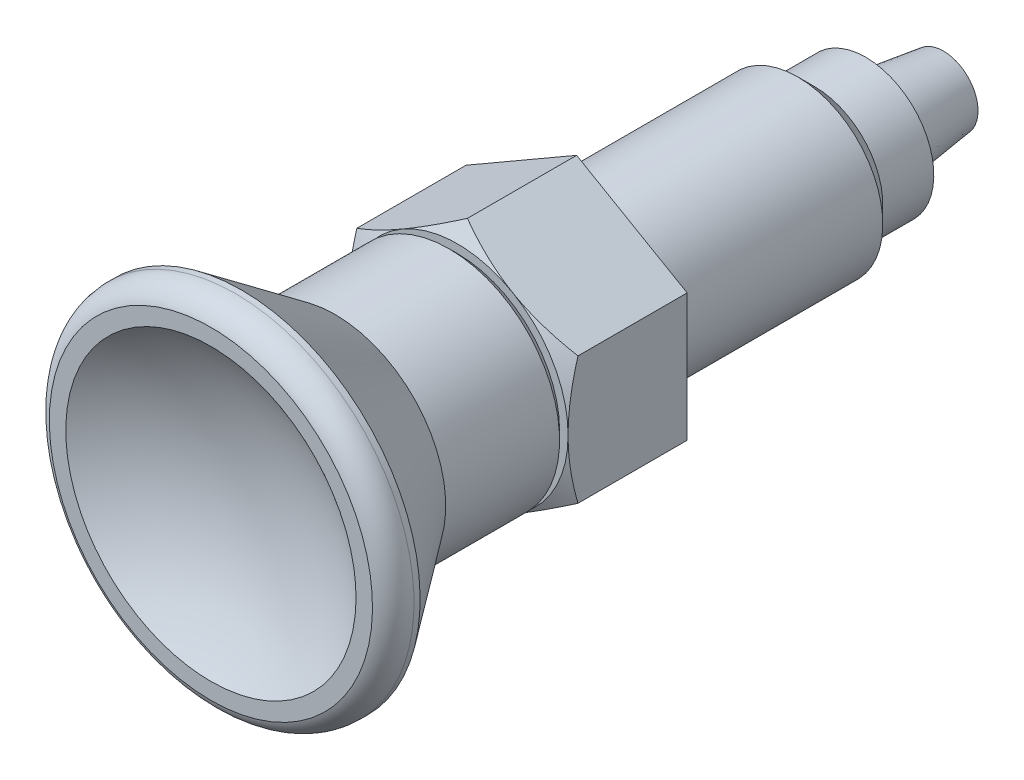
ISO-10303-21;
HEADER;
FILE_DESCRIPTION(('STEP AP214'),'2;1');
FILE_NAME('part.step','',(''),(''),'','','');
FILE_SCHEMA(('AUTOMOTIVE_DESIGN { 1 0 10303 214 1 1 1 1 }'));
ENDSEC;
DATA;
#1=APPLICATION_CONTEXT('core data for automotive mechanical design processes');
#2=APPLICATION_PROTOCOL_DEFINITION('international standard','automotive_design',2000,#1);
#3=PRODUCT_CONTEXT('',#1,'mechanical');
#4=PRODUCT('Part','Part','',(#3));
#5=PRODUCT_RELATED_PRODUCT_CATEGORY('part','',(#4));
#6=PRODUCT_DEFINITION_FORMATION('','',#4);
#7=PRODUCT_DEFINITION_CONTEXT('part definition',#1,'design');
#8=PRODUCT_DEFINITION('design','',#6,#7);
#9=PRODUCT_DEFINITION_SHAPE('','',#8);
#10=(LENGTH_UNIT() NAMED_UNIT(*) SI_UNIT(.MILLI.,.METRE.));
#11=(NAMED_UNIT(*) PLANE_ANGLE_UNIT() SI_UNIT($,.RADIAN.));
#12=(NAMED_UNIT(*) SI_UNIT($,.STERADIAN.) SOLID_ANGLE_UNIT());
#13=UNCERTAINTY_MEASURE_WITH_UNIT(LENGTH_MEASURE(1.E-05),#10,'distance_accuracy_value','');
#14=(GEOMETRIC_REPRESENTATION_CONTEXT(3) GLOBAL_UNCERTAINTY_ASSIGNED_CONTEXT((#13)) GLOBAL_UNIT_ASSIGNED_CONTEXT((#10,
#11,#12)) REPRESENTATION_CONTEXT('',''));
#15=CARTESIAN_POINT('',(0.,0.,0.));
#16=DIRECTION('',(0.,0.,1.));
#17=DIRECTION('',(1.,0.,0.));
#18=AXIS2_PLACEMENT_3D('',#15,#16,#17);
#19=CARTESIAN_POINT('',(0.,0.,-17.));
#20=DIRECTION('',(0.,0.,1.));
#21=DIRECTION('',(0.,1.,0.));
#22=AXIS2_PLACEMENT_3D('',#19,#20,#21);
#23=CYLINDRICAL_SURFACE('',#22,5.);
#24=CARTESIAN_POINT('',(0.,0.,0.));
#25=DIRECTION('',(0.,0.,1.));
#26=DIRECTION('',(0.,1.,0.));
#27=AXIS2_PLACEMENT_3D('',#24,#25,#26);
#28=CIRCLE('',#27,5.);
#29=CARTESIAN_POINT('',(0.,5.,0.));
#30=VERTEX_POINT('',#29);
#31=EDGE_CURVE('E359',#30,#30,#28,.T.);
#32=ORIENTED_EDGE('',*,*,#31,.F.);
#33=EDGE_LOOP('',(#32));
#34=FACE_BOUND('',#33,.T.);
#35=CARTESIAN_POINT('',(0.,0.,-13.));
#36=DIRECTION('',(0.,0.,1.));
#37=DIRECTION('',(0.,1.,0.));
#38=AXIS2_PLACEMENT_3D('',#35,#36,#37);
#39=CIRCLE('',#38,5.);
#40=CARTESIAN_POINT('',(0.,5.,-13.));
#41=VERTEX_POINT('',#40);
#42=EDGE_CURVE('E362',#41,#41,#39,.T.);
#43=ORIENTED_EDGE('',*,*,#42,.T.);
#44=EDGE_LOOP('',(#43));
#45=FACE_BOUND('',#44,.T.);
#46=ADVANCED_FACE('F14',(#34,#45),#23,.T.);
#47=CARTESIAN_POINT('',(-5.,0.,0.));
#48=DIRECTION('',(0.,0.,-1.));
#49=DIRECTION('',(0.,-1.,0.));
#50=AXIS2_PLACEMENT_3D('',#47,#48,#49);
#51=PLANE('',#50);
#52=ORIENTED_EDGE('',*,*,#31,.T.);
#53=EDGE_LOOP('',(#52));
#54=FACE_BOUND('',#53,.T.);
#55=DIRECTION('',(0.,1.,0.));
#56=VECTOR('',#55,1.);
#57=CARTESIAN_POINT('',(6.5,-3.75277674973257,0.));
#58=LINE('',#57,#56);
#59=CARTESIAN_POINT('',(6.5,-3.75277674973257,0.));
#60=VERTEX_POINT('',#59);
#61=CARTESIAN_POINT('',(6.5,3.75277674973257,0.));
#62=VERTEX_POINT('',#61);
#63=EDGE_CURVE('E425',#60,#62,#58,.T.);
#64=ORIENTED_EDGE('',*,*,#63,.F.);
#65=DIRECTION('',(0.866025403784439,0.5,0.));
#66=VECTOR('',#65,1.);
#67=CARTESIAN_POINT('',(0.,-7.50555349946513,0.));
#68=LINE('',#67,#66);
#69=CARTESIAN_POINT('',(0.,-7.50555349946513,0.));
#70=VERTEX_POINT('',#69);
#71=EDGE_CURVE('E430',#70,#60,#68,.T.);
#72=ORIENTED_EDGE('',*,*,#71,.F.);
#73=DIRECTION('',(0.866025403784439,-0.5,0.));
#74=VECTOR('',#73,1.);
#75=CARTESIAN_POINT('',(-6.5,-3.75277674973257,0.));
#76=LINE('',#75,#74);
#77=CARTESIAN_POINT('',(-6.5,-3.75277674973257,0.));
#78=VERTEX_POINT('',#77);
#79=EDGE_CURVE('E376',#78,#70,#76,.T.);
#80=ORIENTED_EDGE('',*,*,#79,.F.);
#81=DIRECTION('',(0.,-1.,0.));
#82=VECTOR('',#81,1.);
#83=CARTESIAN_POINT('',(-6.5,3.75277674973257,0.));
#84=LINE('',#83,#82);
#85=CARTESIAN_POINT('',(-6.5,3.75277674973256,0.));
#86=VERTEX_POINT('',#85);
#87=EDGE_CURVE('E361',#86,#78,#84,.T.);
#88=ORIENTED_EDGE('',*,*,#87,.F.);
#89=DIRECTION('',(-0.866025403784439,-0.5,0.));
#90=VECTOR('',#89,1.);
#91=CARTESIAN_POINT('',(0.,7.50555349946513,0.));
#92=LINE('',#91,#90);
#93=CARTESIAN_POINT('',(0.,7.50555349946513,0.));
#94=VERTEX_POINT('',#93);
#95=EDGE_CURVE('E80',#94,#86,#92,.T.);
#96=ORIENTED_EDGE('',*,*,#95,.F.);
#97=DIRECTION('',(-0.866025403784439,0.5,0.));
#98=VECTOR('',#97,1.);
#99=CARTESIAN_POINT('',(6.5,3.75277674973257,0.));
#100=LINE('',#99,#98);
#101=EDGE_CURVE('E77',#62,#94,#100,.T.);
#102=ORIENTED_EDGE('',*,*,#101,.F.);
#103=EDGE_LOOP('',(#64,#72,#80,#88,#96,#102));
#104=FACE_BOUND('',#103,.T.);
#105=ADVANCED_FACE('F196',(#54,#104),#51,.T.);
#106=CARTESIAN_POINT('',(-6.5,3.75277674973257,0.));
#107=DIRECTION('',(-1.,0.,0.));
#108=DIRECTION('',(0.,-1.,0.));
#109=AXIS2_PLACEMENT_3D('',#106,#107,#108);
#110=PLANE('',#109);
#111=CARTESIAN_POINT('',(-6.5,0.,7.));
#112=CARTESIAN_POINT('',(-6.5,-0.159284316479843,7.0000265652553));
#113=CARTESIAN_POINT('',(-6.5,-0.318560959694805,6.99662027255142));
#114=CARTESIAN_POINT('',(-6.5,-0.636801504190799,6.98313941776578));
#115=CARTESIAN_POINT('',(-6.5,-0.795765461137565,6.97306617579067));
#116=CARTESIAN_POINT('',(-6.5,-1.11235385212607,6.94651520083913));
#117=CARTESIAN_POINT('',(-6.5,-1.26998101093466,6.93006970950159));
#118=CARTESIAN_POINT('',(-6.5,-1.58448433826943,6.89112798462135));
#119=CARTESIAN_POINT('',(-6.5,-1.74136048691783,6.86863159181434));
#120=CARTESIAN_POINT('',(-6.5,-2.2102121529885,6.79276103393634));
#121=CARTESIAN_POINT('',(-6.5,-2.52082563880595,6.73096864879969));
#122=CARTESIAN_POINT('',(-6.5,-3.13938147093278,6.58845960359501));
#123=CARTESIAN_POINT('',(-6.5,-3.44730224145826,6.50764843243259));
#124=CARTESIAN_POINT('',(-6.5,-3.75277666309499,6.41944344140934));
#125=B_SPLINE_CURVE_WITH_KNOTS('',3,(#111,#112,#113,#114,#115,#116,#117,#118,#119,#120,#121,
#122,#123,#124),.UNSPECIFIED.,.F.,.F.,(4,2,2,2,2,2,4),(0.,0.477804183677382,0.955513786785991,
1.43083723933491,1.90617320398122,2.85559928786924,3.80984692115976),.UNSPECIFIED.);
#126=CARTESIAN_POINT('',(-6.5,0.,7.));
#127=VERTEX_POINT('',#126);
#128=CARTESIAN_POINT('',(-6.50000001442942,-3.75277674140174,6.41944341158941));
#129=VERTEX_POINT('',#128);
#130=EDGE_CURVE('E200',#127,#129,#125,.T.);
#131=ORIENTED_EDGE('',*,*,#130,.F.);
#132=CARTESIAN_POINT('',(-6.499999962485,3.75277677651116,6.41944338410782));
#133=CARTESIAN_POINT('',(-6.49999998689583,3.44730234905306,6.50764839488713));
#134=CARTESIAN_POINT('',(-6.49999999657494,3.1393815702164,6.58845957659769));
#135=CARTESIAN_POINT('',(-6.50000000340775,2.5208257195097,6.73096863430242));
#136=CARTESIAN_POINT('',(-6.50000000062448,2.21021222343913,6.79276102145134));
#137=CARTESIAN_POINT('',(-6.49999999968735,1.74136054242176,6.86863158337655));
#138=CARTESIAN_POINT('',(-6.49999999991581,1.58448438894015,6.89112797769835));
#139=CARTESIAN_POINT('',(-6.50000000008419,1.26998105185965,6.93006970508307));
#140=CARTESIAN_POINT('',(-6.5000000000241,1.1123538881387,6.94651519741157));
#141=CARTESIAN_POINT('',(-6.49999999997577,0.79576548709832,6.97306617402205));
#142=CARTESIAN_POINT('',(-6.49999999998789,0.636801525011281,6.98313941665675));
#143=CARTESIAN_POINT('',(-6.50000000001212,0.318560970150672,6.996620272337));
#144=CARTESIAN_POINT('',(-6.50000000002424,0.159284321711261,7.00002656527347));
#145=CARTESIAN_POINT('',(-6.5,0.,7.));
#146=B_SPLINE_CURVE_WITH_KNOTS('',3,(#132,#133,#134,#135,#136,#137,#138,#139,#140,#141,#142,
#143,#144,#145),.UNSPECIFIED.,.F.,.F.,(4,2,2,2,2,2,4),(0.,0.954247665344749,1.90367378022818,
2.37900975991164,2.85433322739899,3.33204284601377,3.80984704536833),.UNSPECIFIED.);
#147=CARTESIAN_POINT('',(-6.5,3.75277676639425,6.41944341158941));
#148=VERTEX_POINT('',#147);
#149=EDGE_CURVE('E206',#148,#127,#146,.T.);
#150=ORIENTED_EDGE('',*,*,#149,.F.);
#151=DIRECTION('',(0.,0.,1.));
#152=VECTOR('',#151,1.);
#153=CARTESIAN_POINT('',(-6.5,3.75277674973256,0.));
#154=LINE('',#153,#152);
#155=EDGE_CURVE('E264',#86,#148,#154,.T.);
#156=ORIENTED_EDGE('',*,*,#155,.F.);
#157=ORIENTED_EDGE('',*,*,#87,.T.);
#158=DIRECTION('',(0.,0.,1.));
#159=VECTOR('',#158,1.);
#160=CARTESIAN_POINT('',(-6.5,-3.75277674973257,0.));
#161=LINE('',#160,#159);
#162=EDGE_CURVE('E366',#129,#78,#161,.F.);
#163=ORIENTED_EDGE('',*,*,#162,.F.);
#164=EDGE_LOOP('',(#131,#150,#156,#157,#163));
#165=FACE_BOUND('',#164,.T.);
#166=ADVANCED_FACE('F190',(#165),#110,.T.);
#167=CARTESIAN_POINT('',(-6.5,-3.75277674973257,0.));
#168=DIRECTION('',(-0.5,-0.866025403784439,0.));
#169=DIRECTION('',(0.866025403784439,-0.5,0.));
#170=AXIS2_PLACEMENT_3D('',#167,#168,#169);
#171=PLANE('',#170);
#172=CARTESIAN_POINT('',(-3.25,-5.62916512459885,7.));
#173=CARTESIAN_POINT('',(-3.1120557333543,-5.70880728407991,7.00002656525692));
#174=CARTESIAN_POINT('',(-2.97411811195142,-5.78844560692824,6.9966202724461));
#175=CARTESIAN_POINT('',(-2.69851371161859,-5.94756588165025,6.98313941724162));
#176=CARTESIAN_POINT('',(-2.5608468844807,-6.02704786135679,6.97306617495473));
#177=CARTESIAN_POINT('',(-2.28667329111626,-6.18534205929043,6.9465151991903));
#178=CARTESIAN_POINT('',(-2.15016416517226,-6.26415563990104,6.9300697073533));
#179=CARTESIAN_POINT('',(-1.87779628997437,-6.42140730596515,6.89112798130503));
#180=CARTESIAN_POINT('',(-1.74193755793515,-6.49984538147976,6.86863158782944));
#181=CARTESIAN_POINT('',(-1.33590009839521,-6.73427121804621,6.79276102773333));
#182=CARTESIAN_POINT('',(-1.06690092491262,-6.88957796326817,6.73096864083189));
#183=CARTESIAN_POINT('',(-0.531215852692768,-7.19885588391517,6.58845959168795));
#184=CARTESIAN_POINT('',(-0.264548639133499,-7.35281627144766,6.50764841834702));
#185=CARTESIAN_POINT('',(-2.59197373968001E-08,-7.50555348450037,6.41944342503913));
#186=B_SPLINE_CURVE_WITH_KNOTS('',3,(#172,#173,#174,#175,#176,#177,#178,#179,#180,#181,#182,
#183,#184,#185),.UNSPECIFIED.,.F.,.F.,(4,2,2,2,2,2,4),(0.,0.477804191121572,0.955513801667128,
1.43083726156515,1.90617323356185,2.85559933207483,3.80984698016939),.UNSPECIFIED.);
#187=CARTESIAN_POINT('',(-3.25,-5.62916512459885,7.));
#188=VERTEX_POINT('',#187);
#189=CARTESIAN_POINT('',(1.15429025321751E-08,-7.50555349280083,6.41944342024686));
#190=VERTEX_POINT('',#189);
#191=EDGE_CURVE('E173',#188,#190,#186,.T.);
#192=ORIENTED_EDGE('',*,*,#191,.F.);
#193=CARTESIAN_POINT('',(-6.50000000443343,-3.7527767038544,6.41944338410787));
#194=CARTESIAN_POINT('',(-6.2354514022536,-3.90551393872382,6.50764839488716));
#195=CARTESIAN_POINT('',(-5.96878419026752,-4.0594743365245,6.5884595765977));
#196=CARTESIAN_POINT('',(-5.43309911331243,-4.36875226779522,6.73096863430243));
#197=CARTESIAN_POINT('',(-5.16409993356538,-4.52405901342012,6.79276102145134));
#198=CARTESIAN_POINT('',(-4.75806246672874,-4.75848485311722,6.86863158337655));
#199=CARTESIAN_POINT('',(-4.62220373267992,-4.83692293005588,6.89112797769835));
#200=CARTESIAN_POINT('',(-4.34983585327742,-4.99417459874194,6.93006970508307));
#201=CARTESIAN_POINT('',(-4.21332672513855,-5.07298818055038,6.94651519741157));
#202=CARTESIAN_POINT('',(-3.93915312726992,-5.23128238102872,6.97306617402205));
#203=CARTESIAN_POINT('',(-3.80148629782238,-5.31076436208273,6.98313941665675));
#204=CARTESIAN_POINT('',(-3.52588189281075,-5.46988463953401,6.996620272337));
#205=CARTESIAN_POINT('',(-3.38794426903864,-5.54952296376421,7.00002656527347));
#206=CARTESIAN_POINT('',(-3.25,-5.62916512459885,7.));
#207=B_SPLINE_CURVE_WITH_KNOTS('',3,(#193,#194,#195,#196,#197,#198,#199,#200,#201,#202,#203,
#204,#205,#206),.UNSPECIFIED.,.F.,.F.,(4,2,2,2,2,2,4),(0.,0.954247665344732,1.90367378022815,
2.3790097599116,2.85433322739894,3.33204284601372,3.80984704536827),.UNSPECIFIED.);
#208=EDGE_CURVE('E180',#129,#188,#207,.T.);
#209=ORIENTED_EDGE('',*,*,#208,.F.);
#210=ORIENTED_EDGE('',*,*,#162,.T.);
#211=ORIENTED_EDGE('',*,*,#79,.T.);
#212=DIRECTION('',(0.,0.,1.));
#213=VECTOR('',#212,1.);
#214=CARTESIAN_POINT('',(0.,-7.50555349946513,0.));
#215=LINE('',#214,#213);
#216=EDGE_CURVE('E441',#190,#70,#215,.F.);
#217=ORIENTED_EDGE('',*,*,#216,.F.);
#218=EDGE_LOOP('',(#192,#209,#210,#211,#217));
#219=FACE_BOUND('',#218,.T.);
#220=ADVANCED_FACE('F186',(#219),#171,.T.);
#221=CARTESIAN_POINT('',(0.,-7.50555349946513,0.));
#222=DIRECTION('',(0.5,-0.866025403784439,0.));
#223=DIRECTION('',(0.866025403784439,0.5,0.));
#224=AXIS2_PLACEMENT_3D('',#221,#222,#223);
#225=PLANE('',#224);
#226=CARTESIAN_POINT('',(3.25,-5.62916512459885,7.));
#227=CARTESIAN_POINT('',(3.38794426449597,-5.54952296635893,7.0000265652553));
#228=CARTESIAN_POINT('',(3.52588188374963,-5.46988464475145,6.99662027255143));
#229=CARTESIAN_POINT('',(3.80148627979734,-5.31076437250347,6.98313941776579));
#230=CARTESIAN_POINT('',(3.93915310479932,-5.23128239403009,6.97306617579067));
#231=CARTESIAN_POINT('',(4.21332669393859,-5.07298819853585,6.94651520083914));
#232=CARTESIAN_POINT('',(4.34983581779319,-4.99417461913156,6.9300697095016));
#233=CARTESIAN_POINT('',(4.62220368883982,-4.83692295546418,6.89112798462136));
#234=CARTESIAN_POINT('',(4.75806241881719,-4.75848488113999,6.86863159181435));
#235=CARTESIAN_POINT('',(5.16409987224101,-4.52405904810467,6.79276103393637));
#236=CARTESIAN_POINT('',(5.43309904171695,-4.36875230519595,6.73096864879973));
#237=CARTESIAN_POINT('',(5.96878410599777,-4.05947438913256,6.58845960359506));
#238=CARTESIAN_POINT('',(6.2354513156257,-3.90551400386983,6.50764843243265));
#239=CARTESIAN_POINT('',(6.49999992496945,-3.75277679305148,6.41944344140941));
#240=B_SPLINE_CURVE_WITH_KNOTS('',3,(#226,#227,#228,#229,#230,#231,#232,#233,#234,#235,#236,
#237,#238,#239),.UNSPECIFIED.,.F.,.F.,(4,2,2,2,2,2,4),(0.,0.477804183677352,0.95551378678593,
1.43083723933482,1.9061732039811,2.85559928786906,3.80984692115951),.UNSPECIFIED.);
#241=CARTESIAN_POINT('',(3.25,-5.62916512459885,7.));
#242=VERTEX_POINT('',#241);
#243=CARTESIAN_POINT('',(6.5,-3.75277676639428,6.4194434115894));
#244=VERTEX_POINT('',#243);
#245=EDGE_CURVE('E145',#242,#244,#240,.T.);
#246=ORIENTED_EDGE('',*,*,#245,.F.);
#247=CARTESIAN_POINT('',(1.65411278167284E-08,-7.50555346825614,6.41944341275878));
#248=CARTESIAN_POINT('',(0.264548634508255,-7.35281626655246,6.50764841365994));
#249=CARTESIAN_POINT('',(0.531215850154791,-7.19885588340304,6.58845959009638));
#250=CARTESIAN_POINT('',(1.06690092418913,-6.88957796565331,6.73096864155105));
#251=CARTESIAN_POINT('',(1.335900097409,-6.73427121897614,6.79276102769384));
#252=CARTESIAN_POINT('',(1.74193755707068,-6.49984538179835,6.86863158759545));
#253=CARTESIAN_POINT('',(1.87779628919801,-6.42140730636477,6.89112798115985));
#254=CARTESIAN_POINT('',(2.15016416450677,-6.26415564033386,6.93006970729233));
#255=CARTESIAN_POINT('',(2.28667329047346,-6.18534205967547,6.94651519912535));
#256=CARTESIAN_POINT('',(2.56084688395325,-6.02704786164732,6.97306617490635));
#257=CARTESIAN_POINT('',(2.69851371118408,-5.94756588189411,6.98313941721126));
#258=CARTESIAN_POINT('',(2.97411811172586,-5.78844560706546,6.99662027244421));
#259=CARTESIAN_POINT('',(3.11205573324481,-5.70880728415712,7.00002656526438));
#260=CARTESIAN_POINT('',(3.25,-5.62916512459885,7.));
#261=B_SPLINE_CURVE_WITH_KNOTS('',3,(#247,#248,#249,#250,#251,#252,#253,#254,#255,#256,#257,
#258,#259,#260),.UNSPECIFIED.,.F.,.F.,(4,2,2,2,2,2,4),(0.,0.954247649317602,1.90367374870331,
2.37900972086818,2.85433318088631,3.332042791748,3.80984698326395),.UNSPECIFIED.);
#262=EDGE_CURVE('E167',#190,#242,#261,.T.);
#263=ORIENTED_EDGE('',*,*,#262,.F.);
#264=ORIENTED_EDGE('',*,*,#216,.T.);
#265=ORIENTED_EDGE('',*,*,#71,.T.);
#266=DIRECTION('',(0.,0.,1.));
#267=VECTOR('',#266,1.);
#268=CARTESIAN_POINT('',(6.5,-3.75277674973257,0.));
#269=LINE('',#268,#267);
#270=EDGE_CURVE('E435',#244,#60,#269,.F.);
#271=ORIENTED_EDGE('',*,*,#270,.F.);
#272=EDGE_LOOP('',(#246,#263,#264,#265,#271));
#273=FACE_BOUND('',#272,.T.);
#274=ADVANCED_FACE('F127',(#273),#225,.T.);
#275=CARTESIAN_POINT('',(6.5,-3.75277674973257,0.));
#276=DIRECTION('',(1.,0.,0.));
#277=DIRECTION('',(0.,1.,0.));
#278=AXIS2_PLACEMENT_3D('',#275,#276,#277);
#279=PLANE('',#278);
#280=CARTESIAN_POINT('',(6.5,0.,7.));
#281=CARTESIAN_POINT('',(6.5,0.159284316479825,7.0000265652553));
#282=CARTESIAN_POINT('',(6.5,0.318560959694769,6.99662027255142));
#283=CARTESIAN_POINT('',(6.5,0.636801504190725,6.98313941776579));
#284=CARTESIAN_POINT('',(6.5,0.795765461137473,6.97306617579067));
#285=CARTESIAN_POINT('',(6.5,1.11235385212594,6.94651520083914));
#286=CARTESIAN_POINT('',(6.5,1.26998101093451,6.93006970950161));
#287=CARTESIAN_POINT('',(6.5,1.58448433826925,6.89112798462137));
#288=CARTESIAN_POINT('',(6.5,1.74136048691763,6.86863159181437));
#289=CARTESIAN_POINT('',(6.5,2.21021215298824,6.79276103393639));
#290=CARTESIAN_POINT('',(6.5,2.52082563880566,6.73096864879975));
#291=CARTESIAN_POINT('',(6.5,3.13938147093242,6.58845960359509));
#292=CARTESIAN_POINT('',(6.5,3.44730224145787,6.50764843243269));
#293=CARTESIAN_POINT('',(6.5,3.75277666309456,6.41944344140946));
#294=B_SPLINE_CURVE_WITH_KNOTS('',3,(#280,#281,#282,#283,#284,#285,#286,#287,#288,#289,#290,
#291,#292,#293),.UNSPECIFIED.,.F.,.F.,(4,2,2,2,2,2,4),(0.,0.477804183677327,0.95551378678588,
1.43083723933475,1.906173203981,2.85559928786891,3.80984692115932),.UNSPECIFIED.);
#295=CARTESIAN_POINT('',(6.5,0.,7.));
#296=VERTEX_POINT('',#295);
#297=CARTESIAN_POINT('',(6.50000001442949,3.7527767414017,6.41944341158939));
#298=VERTEX_POINT('',#297);
#299=EDGE_CURVE('E95',#296,#298,#294,.T.);
#300=ORIENTED_EDGE('',*,*,#299,.F.);
#301=CARTESIAN_POINT('',(6.49999996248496,-3.75277677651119,6.41944338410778));
#302=CARTESIAN_POINT('',(6.49999998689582,-3.44730234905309,6.50764839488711));
#303=CARTESIAN_POINT('',(6.49999999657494,-3.13938157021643,6.58845957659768));
#304=CARTESIAN_POINT('',(6.50000000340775,-2.52082571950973,6.73096863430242));
#305=CARTESIAN_POINT('',(6.50000000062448,-2.21021222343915,6.79276102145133));
#306=CARTESIAN_POINT('',(6.49999999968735,-1.74136054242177,6.86863158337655));
#307=CARTESIAN_POINT('',(6.49999999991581,-1.58448438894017,6.89112797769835));
#308=CARTESIAN_POINT('',(6.50000000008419,-1.26998105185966,6.93006970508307));
#309=CARTESIAN_POINT('',(6.5000000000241,-1.11235388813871,6.94651519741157));
#310=CARTESIAN_POINT('',(6.49999999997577,-0.795765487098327,6.97306617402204));
#311=CARTESIAN_POINT('',(6.49999999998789,-0.636801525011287,6.98313941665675));
#312=CARTESIAN_POINT('',(6.50000000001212,-0.318560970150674,6.996620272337));
#313=CARTESIAN_POINT('',(6.50000000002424,-0.159284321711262,7.00002656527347));
#314=CARTESIAN_POINT('',(6.5,0.,7.));
#315=B_SPLINE_CURVE_WITH_KNOTS('',3,(#301,#302,#303,#304,#305,#306,#307,#308,#309,#310,#311,
#312,#313,#314),.UNSPECIFIED.,.F.,.F.,(4,2,2,2,2,2,4),(0.,0.954247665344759,1.9036737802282,
2.37900975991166,2.85433322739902,3.3320428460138,3.80984704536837),.UNSPECIFIED.);
#316=EDGE_CURVE('E137',#244,#296,#315,.T.);
#317=ORIENTED_EDGE('',*,*,#316,.F.);
#318=ORIENTED_EDGE('',*,*,#270,.T.);
#319=ORIENTED_EDGE('',*,*,#63,.T.);
#320=DIRECTION('',(0.,0.,1.));
#321=VECTOR('',#320,1.);
#322=CARTESIAN_POINT('',(6.5,3.75277674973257,0.));
#323=LINE('',#322,#321);
#324=EDGE_CURVE('E434',#298,#62,#323,.F.);
#325=ORIENTED_EDGE('',*,*,#324,.F.);
#326=EDGE_LOOP('',(#300,#317,#318,#319,#325));
#327=FACE_BOUND('',#326,.T.);
#328=ADVANCED_FACE('F120',(#327),#279,.T.);
#329=CARTESIAN_POINT('',(6.5,3.75277674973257,0.));
#330=DIRECTION('',(0.5,0.866025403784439,0.));
#331=DIRECTION('',(-0.866025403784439,0.5,0.));
#332=AXIS2_PLACEMENT_3D('',#329,#330,#331);
#333=PLANE('',#332);
#334=CARTESIAN_POINT('',(3.25,5.62916512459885,7.));
#335=CARTESIAN_POINT('',(3.11205573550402,5.70880728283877,7.00002656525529));
#336=CARTESIAN_POINT('',(2.97411811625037,5.78844560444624,6.99662027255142));
#337=CARTESIAN_POINT('',(2.69851372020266,5.94756587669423,6.98313941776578));
#338=CARTESIAN_POINT('',(2.56084689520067,6.02704785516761,6.97306617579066));
#339=CARTESIAN_POINT('',(2.2866733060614,6.18534205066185,6.94651520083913));
#340=CARTESIAN_POINT('',(2.15016418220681,6.26415563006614,6.93006970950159));
#341=CARTESIAN_POINT('',(1.87779631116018,6.42140729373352,6.89112798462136));
#342=CARTESIAN_POINT('',(1.74193758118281,6.49984536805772,6.86863159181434));
#343=CARTESIAN_POINT('',(1.33590012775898,6.73427120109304,6.79276103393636));
#344=CARTESIAN_POINT('',(1.06690095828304,6.88957794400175,6.73096864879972));
#345=CARTESIAN_POINT('',(0.531215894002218,7.19885586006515,6.58845960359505));
#346=CARTESIAN_POINT('',(0.264548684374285,7.35281624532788,6.50764843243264));
#347=CARTESIAN_POINT('',(7.50305377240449E-08,7.50555345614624,6.4194434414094));
#348=B_SPLINE_CURVE_WITH_KNOTS('',3,(#334,#335,#336,#337,#338,#339,#340,#341,#342,#343,#344,
#345,#346,#347),.UNSPECIFIED.,.F.,.F.,(4,2,2,2,2,2,4),(0.,0.477804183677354,0.955513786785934,
1.43083723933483,1.90617320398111,2.85559928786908,3.80984692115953),.UNSPECIFIED.);
#349=CARTESIAN_POINT('',(3.25,5.62916512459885,7.));
#350=VERTEX_POINT('',#349);
#351=CARTESIAN_POINT('',(1.44294555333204E-08,7.50555350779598,6.41944341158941));
#352=VERTEX_POINT('',#351);
#353=EDGE_CURVE('E34',#350,#352,#348,.T.);
#354=ORIENTED_EDGE('',*,*,#353,.F.);
#355=CARTESIAN_POINT('',(6.50000000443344,3.75277670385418,6.41944338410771));
#356=CARTESIAN_POINT('',(6.23545140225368,3.9055139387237,6.50764839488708));
#357=CARTESIAN_POINT('',(5.96878419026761,4.05947433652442,6.58845957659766));
#358=CARTESIAN_POINT('',(5.43309911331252,4.36875226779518,6.73096863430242));
#359=CARTESIAN_POINT('',(5.16409993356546,4.52405901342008,6.79276102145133));
#360=CARTESIAN_POINT('',(4.7580624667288,4.75848485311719,6.86863158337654));
#361=CARTESIAN_POINT('',(4.62220373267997,4.83692293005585,6.89112797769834));
#362=CARTESIAN_POINT('',(4.34983585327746,4.99417459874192,6.93006970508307));
#363=CARTESIAN_POINT('',(4.21332672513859,5.07298818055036,6.94651519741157));
#364=CARTESIAN_POINT('',(3.93915312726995,5.2312823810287,6.97306617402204));
#365=CARTESIAN_POINT('',(3.8014862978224,5.31076436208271,6.98313941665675));
#366=CARTESIAN_POINT('',(3.52588189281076,5.469884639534,6.996620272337));
#367=CARTESIAN_POINT('',(3.38794426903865,5.54952296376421,7.00002656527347));
#368=CARTESIAN_POINT('',(3.25,5.62916512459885,7.));
#369=B_SPLINE_CURVE_WITH_KNOTS('',3,(#355,#356,#357,#358,#359,#360,#361,#362,#363,#364,#365,
#366,#367,#368),.UNSPECIFIED.,.F.,.F.,(4,2,2,2,2,2,4),(0.,0.954247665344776,1.90367378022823,
2.3790097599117,2.85433322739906,3.33204284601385,3.80984704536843),.UNSPECIFIED.);
#370=EDGE_CURVE('E93',#298,#350,#369,.T.);
#371=ORIENTED_EDGE('',*,*,#370,.F.);
#372=ORIENTED_EDGE('',*,*,#324,.T.);
#373=ORIENTED_EDGE('',*,*,#101,.T.);
#374=DIRECTION('',(0.,0.,1.));
#375=VECTOR('',#374,1.);
#376=CARTESIAN_POINT('',(0.,7.50555349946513,0.));
#377=LINE('',#376,#375);
#378=EDGE_CURVE('E72',#352,#94,#377,.F.);
#379=ORIENTED_EDGE('',*,*,#378,.F.);
#380=EDGE_LOOP('',(#354,#371,#372,#373,#379));
#381=FACE_BOUND('',#380,.T.);
#382=ADVANCED_FACE('F73',(#381),#333,.T.);
#383=CARTESIAN_POINT('',(0.,7.50555349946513,0.));
#384=DIRECTION('',(-0.5,0.866025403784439,0.));
#385=DIRECTION('',(-0.866025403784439,-0.5,0.));
#386=AXIS2_PLACEMENT_3D('',#383,#384,#385);
#387=PLANE('',#386);
#388=CARTESIAN_POINT('',(-3.25,5.62916512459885,7.));
#389=CARTESIAN_POINT('',(-3.38794426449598,5.54952296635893,7.0000265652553));
#390=CARTESIAN_POINT('',(-3.52588188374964,5.46988464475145,6.99662027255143));
#391=CARTESIAN_POINT('',(-3.80148627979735,5.31076437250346,6.98313941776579));
#392=CARTESIAN_POINT('',(-3.93915310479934,5.23128239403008,6.97306617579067));
#393=CARTESIAN_POINT('',(-4.21332669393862,5.07298819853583,6.94651520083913));
#394=CARTESIAN_POINT('',(-4.34983581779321,4.99417461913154,6.9300697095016));
#395=CARTESIAN_POINT('',(-4.62220368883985,4.83692295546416,6.89112798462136));
#396=CARTESIAN_POINT('',(-4.75806241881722,4.75848488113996,6.86863159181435));
#397=CARTESIAN_POINT('',(-5.16409987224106,4.52405904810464,6.79276103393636));
#398=CARTESIAN_POINT('',(-5.43309904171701,4.36875230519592,6.73096864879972));
#399=CARTESIAN_POINT('',(-5.96878410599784,4.05947438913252,6.58845960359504));
#400=CARTESIAN_POINT('',(-6.23545131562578,3.90551400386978,6.50764843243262));
#401=CARTESIAN_POINT('',(-6.49999992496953,3.75277679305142,6.41944344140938));
#402=B_SPLINE_CURVE_WITH_KNOTS('',3,(#388,#389,#390,#391,#392,#393,#394,#395,#396,#397,#398,
#399,#400,#401),.UNSPECIFIED.,.F.,.F.,(4,2,2,2,2,2,4),(0.,0.477804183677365,0.955513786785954,
1.43083723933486,1.90617320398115,2.85559928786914,3.80984692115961),.UNSPECIFIED.);
#403=CARTESIAN_POINT('',(-3.25,5.62916512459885,7.));
#404=VERTEX_POINT('',#403);
#405=EDGE_CURVE('E68',#404,#148,#402,.T.);
#406=ORIENTED_EDGE('',*,*,#405,.F.);
#407=CARTESIAN_POINT('',(4.1948478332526E-08,7.50555348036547,6.41944338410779));
#408=CARTESIAN_POINT('',(-0.264548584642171,7.35281628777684,6.50764839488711));
#409=CARTESIAN_POINT('',(-0.531215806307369,7.19885590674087,6.58845957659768));
#410=CARTESIAN_POINT('',(-1.06690089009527,6.88957798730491,6.73096863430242));
#411=CARTESIAN_POINT('',(-1.33590006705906,6.73427123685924,6.79276102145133));
#412=CARTESIAN_POINT('',(-1.74193753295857,6.49984539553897,6.86863158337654));
#413=CARTESIAN_POINT('',(-1.87779626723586,6.42140731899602,6.89112797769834));
#414=CARTESIAN_POINT('',(-2.15016414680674,6.26415565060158,6.93006970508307));
#415=CARTESIAN_POINT('',(-2.28667327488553,6.18534206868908,6.94651519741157));
#416=CARTESIAN_POINT('',(-2.56084687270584,6.02704786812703,6.97306617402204));
#417=CARTESIAN_POINT('',(-2.6985137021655,5.947565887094,6.98313941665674));
#418=CARTESIAN_POINT('',(-2.97411810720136,5.78844560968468,6.996620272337));
#419=CARTESIAN_POINT('',(-3.11205573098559,5.70880728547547,7.00002656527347));
#420=CARTESIAN_POINT('',(-3.25,5.62916512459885,7.));
#421=B_SPLINE_CURVE_WITH_KNOTS('',3,(#407,#408,#409,#410,#411,#412,#413,#414,#415,#416,#417,
#418,#419,#420),.UNSPECIFIED.,.F.,.F.,(4,2,2,2,2,2,4),(0.,0.954247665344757,1.9036737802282,
2.37900975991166,2.85433322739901,3.33204284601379,3.80984704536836),.UNSPECIFIED.);
#422=EDGE_CURVE('E83',#352,#404,#421,.T.);
#423=ORIENTED_EDGE('',*,*,#422,.F.);
#424=ORIENTED_EDGE('',*,*,#378,.T.);
#425=ORIENTED_EDGE('',*,*,#95,.T.);
#426=ORIENTED_EDGE('',*,*,#155,.T.);
#427=EDGE_LOOP('',(#406,#423,#424,#425,#426));
#428=FACE_BOUND('',#427,.T.);
#429=ADVANCED_FACE('F84',(#428),#387,.T.);
#430=CARTESIAN_POINT('',(0.,0.,6.41596007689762));
#431=DIRECTION('',(0.,0.,-1.));
#432=DIRECTION('',(0.,-1.,0.));
#433=AXIS2_PLACEMENT_3D('',#430,#431,#432);
#434=CONICAL_SURFACE('',#433,7.51158682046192,1.0471975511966);
#435=ORIENTED_EDGE('',*,*,#149,.T.);
#436=CARTESIAN_POINT('',(0.,0.,7.));
#437=DIRECTION('',(0.,0.,-1.));
#438=DIRECTION('',(0.,-1.,0.));
#439=AXIS2_PLACEMENT_3D('',#436,#437,#438);
#440=CIRCLE('',#439,6.5);
#441=EDGE_CURVE('E88',#404,#127,#440,.F.);
#442=ORIENTED_EDGE('',*,*,#441,.F.);
#443=ORIENTED_EDGE('',*,*,#405,.T.);
#444=EDGE_LOOP('',(#435,#442,#443));
#445=FACE_BOUND('',#444,.T.);
#446=ADVANCED_FACE('F218',(#445),#434,.T.);
#447=CARTESIAN_POINT('',(0.,0.,6.41596007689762));
#448=DIRECTION('',(0.,0.,-1.));
#449=DIRECTION('',(0.,-1.,0.));
#450=AXIS2_PLACEMENT_3D('',#447,#448,#449);
#451=CONICAL_SURFACE('',#450,7.51158682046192,1.0471975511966);
#452=ORIENTED_EDGE('',*,*,#130,.T.);
#453=ORIENTED_EDGE('',*,*,#208,.T.);
#454=CARTESIAN_POINT('',(0.,0.,7.));
#455=DIRECTION('',(0.,0.,-1.));
#456=DIRECTION('',(0.,-1.,0.));
#457=AXIS2_PLACEMENT_3D('',#454,#455,#456);
#458=CIRCLE('',#457,6.5);
#459=EDGE_CURVE('E462',#127,#188,#458,.F.);
#460=ORIENTED_EDGE('',*,*,#459,.F.);
#461=EDGE_LOOP('',(#452,#453,#460));
#462=FACE_BOUND('',#461,.T.);
#463=ADVANCED_FACE('F163',(#462),#451,.T.);
#464=CARTESIAN_POINT('',(0.,0.,6.41596007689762));
#465=DIRECTION('',(0.,0.,-1.));
#466=DIRECTION('',(0.,-1.,0.));
#467=AXIS2_PLACEMENT_3D('',#464,#465,#466);
#468=CONICAL_SURFACE('',#467,7.51158682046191,1.0471975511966);
#469=ORIENTED_EDGE('',*,*,#191,.T.);
#470=ORIENTED_EDGE('',*,*,#262,.T.);
#471=CARTESIAN_POINT('',(0.,0.,7.));
#472=DIRECTION('',(0.,0.,-1.));
#473=DIRECTION('',(0.,-1.,0.));
#474=AXIS2_PLACEMENT_3D('',#471,#472,#473);
#475=CIRCLE('',#474,6.5);
#476=EDGE_CURVE('E460',#188,#242,#475,.F.);
#477=ORIENTED_EDGE('',*,*,#476,.F.);
#478=EDGE_LOOP('',(#469,#470,#477));
#479=FACE_BOUND('',#478,.T.);
#480=ADVANCED_FACE('F156',(#479),#468,.T.);
#481=CARTESIAN_POINT('',(0.,0.,6.41596007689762));
#482=DIRECTION('',(0.,0.,-1.));
#483=DIRECTION('',(0.,-1.,0.));
#484=AXIS2_PLACEMENT_3D('',#481,#482,#483);
#485=CONICAL_SURFACE('',#484,7.51158682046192,1.0471975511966);
#486=ORIENTED_EDGE('',*,*,#245,.T.);
#487=ORIENTED_EDGE('',*,*,#316,.T.);
#488=CARTESIAN_POINT('',(0.,0.,7.));
#489=DIRECTION('',(0.,0.,-1.));
#490=DIRECTION('',(0.,-1.,0.));
#491=AXIS2_PLACEMENT_3D('',#488,#489,#490);
#492=CIRCLE('',#491,6.5);
#493=EDGE_CURVE('E454',#242,#296,#492,.F.);
#494=ORIENTED_EDGE('',*,*,#493,.F.);
#495=EDGE_LOOP('',(#486,#487,#494));
#496=FACE_BOUND('',#495,.T.);
#497=ADVANCED_FACE('F151',(#496),#485,.T.);
#498=CARTESIAN_POINT('',(0.,0.,6.41596007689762));
#499=DIRECTION('',(0.,0.,-1.));
#500=DIRECTION('',(0.,-1.,0.));
#501=AXIS2_PLACEMENT_3D('',#498,#499,#500);
#502=CONICAL_SURFACE('',#501,7.51158682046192,1.0471975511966);
#503=ORIENTED_EDGE('',*,*,#370,.T.);
#504=CARTESIAN_POINT('',(0.,0.,7.));
#505=DIRECTION('',(0.,0.,-1.));
#506=DIRECTION('',(0.,-1.,0.));
#507=AXIS2_PLACEMENT_3D('',#504,#505,#506);
#508=CIRCLE('',#507,6.5);
#509=EDGE_CURVE('E456',#296,#350,#508,.F.);
#510=ORIENTED_EDGE('',*,*,#509,.F.);
#511=ORIENTED_EDGE('',*,*,#299,.T.);
#512=EDGE_LOOP('',(#503,#510,#511));
#513=FACE_BOUND('',#512,.T.);
#514=ADVANCED_FACE('F155',(#513),#502,.T.);
#515=CARTESIAN_POINT('',(0.,0.,6.41596007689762));
#516=DIRECTION('',(0.,0.,-1.));
#517=DIRECTION('',(0.,-1.,0.));
#518=AXIS2_PLACEMENT_3D('',#515,#516,#517);
#519=CONICAL_SURFACE('',#518,7.51158682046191,1.0471975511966);
#520=ORIENTED_EDGE('',*,*,#422,.T.);
#521=CARTESIAN_POINT('',(0.,0.,7.));
#522=DIRECTION('',(0.,0.,-1.));
#523=DIRECTION('',(0.,-1.,0.));
#524=AXIS2_PLACEMENT_3D('',#521,#522,#523);
#525=CIRCLE('',#524,6.5);
#526=EDGE_CURVE('E91',#350,#404,#525,.F.);
#527=ORIENTED_EDGE('',*,*,#526,.F.);
#528=ORIENTED_EDGE('',*,*,#353,.T.);
#529=EDGE_LOOP('',(#520,#527,#528));
#530=FACE_BOUND('',#529,.T.);
#531=ADVANCED_FACE('F90',(#530),#519,.T.);
#532=CARTESIAN_POINT('',(0.,0.,32.6));
#533=DIRECTION('',(1.,0.,0.));
#534=DIRECTION('',(0.,-1.,0.));
#535=AXIS2_PLACEMENT_3D('',#532,#533,#534);
#536=SPHERICAL_SURFACE('',#535,14.);
#537=CARTESIAN_POINT('',(0.,-8.53170557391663,21.5));
#538=CARTESIAN_POINT('',(0.239701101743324,-8.53170729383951,21.5));
#539=CARTESIAN_POINT('',(0.479373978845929,-8.52159969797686,21.5));
#540=CARTESIAN_POINT('',(0.957096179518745,-8.48123987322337,21.5));
#541=CARTESIAN_POINT('',(1.19514505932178,-8.45098234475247,21.5));
#542=CARTESIAN_POINT('',(1.66809840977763,-8.37048717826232,21.5));
#543=CARTESIAN_POINT('',(1.90299924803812,-8.3202282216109,21.5));
#544=CARTESIAN_POINT('',(2.36773233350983,-8.20008811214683,21.5));
#545=CARTESIAN_POINT('',(2.59756451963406,-8.13020672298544,21.5));
#546=CARTESIAN_POINT('',(3.05040854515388,-7.97135842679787,21.5));
#547=CARTESIAN_POINT('',(3.27342368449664,-7.88240092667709,21.5));
#548=CARTESIAN_POINT('',(3.71116976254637,-7.68601114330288,21.5));
#549=CARTESIAN_POINT('',(3.92590057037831,-7.5785785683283,21.5));
#550=CARTESIAN_POINT('',(4.34545679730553,-7.34605366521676,21.5));
#551=CARTESIAN_POINT('',(4.55028643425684,-7.22096894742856,21.5));
#552=CARTESIAN_POINT('',(4.94875279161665,-6.95394741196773,21.5));
#553=CARTESIAN_POINT('',(5.14238561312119,-6.81200477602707,21.5));
#554=CARTESIAN_POINT('',(5.51699044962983,-6.51232267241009,21.5));
#555=CARTESIAN_POINT('',(5.69796342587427,-6.35458440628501,21.5));
#556=CARTESIAN_POINT('',(6.04598097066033,-6.0244208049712,21.5));
#557=CARTESIAN_POINT('',(6.21302532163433,-5.85199524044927,21.5));
#558=CARTESIAN_POINT('',(6.53199815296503,-5.49368132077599,21.5));
#559=CARTESIAN_POINT('',(6.6839263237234,-5.30779269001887,21.5));
#560=CARTESIAN_POINT('',(6.97158596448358,-4.92387306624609,21.5));
#561=CARTESIAN_POINT('',(7.10731707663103,-4.72584180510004,21.5));
#562=CARTESIAN_POINT('',(7.36158785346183,-4.31908993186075,21.5));
#563=CARTESIAN_POINT('',(7.48013099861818,-4.11037149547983,21.5));
#564=CARTESIAN_POINT('',(7.69925411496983,-3.68361770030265,21.5));
#565=CARTESIAN_POINT('',(7.79982785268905,-3.46557914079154,21.5));
#566=CARTESIAN_POINT('',(7.98222972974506,-3.02184395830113,21.5));
#567=CARTESIAN_POINT('',(8.06406129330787,-2.79614874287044,21.5));
#568=CARTESIAN_POINT('',(8.20842175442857,-2.33866337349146,21.5));
#569=CARTESIAN_POINT('',(8.27095035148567,-2.10687312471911,21.5));
#570=CARTESIAN_POINT('',(8.37625770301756,-1.63885297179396,21.5));
#571=CARTESIAN_POINT('',(8.41903679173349,-1.40262314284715,21.5));
#572=CARTESIAN_POINT('',(8.48454328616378,-0.927394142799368,21.5));
#573=CARTESIAN_POINT('',(8.5072702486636,-0.688394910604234,21.5));
#574=CARTESIAN_POINT('',(8.53250695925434,-0.209376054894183,21.5));
#575=CARTESIAN_POINT('',(8.53502046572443,0.0306433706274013,21.5));
#576=CARTESIAN_POINT('',(8.5198196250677,0.510124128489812,21.5));
#577=CARTESIAN_POINT('',(8.50209827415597,0.749585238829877,21.5));
#578=CARTESIAN_POINT('',(8.44654739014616,1.22611973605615,21.5));
#579=CARTESIAN_POINT('',(8.40872148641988,1.46319354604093,21.5));
#580=CARTESIAN_POINT('',(8.31323191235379,1.93331562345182,21.5));
#581=CARTESIAN_POINT('',(8.25556793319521,2.16636382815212,21.5));
#582=CARTESIAN_POINT('',(8.12081350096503,2.62676991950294,21.5));
#583=CARTESIAN_POINT('',(8.04372339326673,2.85412790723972,21.5));
#584=CARTESIAN_POINT('',(7.87066231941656,3.30154649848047,21.5));
#585=CARTESIAN_POINT('',(7.77469093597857,3.52160694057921,21.5));
#586=CARTESIAN_POINT('',(7.56457013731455,3.95282077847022,21.5));
#587=CARTESIAN_POINT('',(7.45042407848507,4.16397580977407,21.5));
#588=CARTESIAN_POINT('',(7.20470986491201,4.57599267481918,21.5));
#589=CARTESIAN_POINT('',(7.07313569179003,4.77685091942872,21.5));
#590=CARTESIAN_POINT('',(6.79355690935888,5.16673175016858,21.5));
#591=CARTESIAN_POINT('',(6.64555528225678,5.35575647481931,21.5));
#592=CARTESIAN_POINT('',(6.33415193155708,5.72066897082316,21.5));
#593=CARTESIAN_POINT('',(6.17074996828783,5.89655653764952,21.5));
#594=CARTESIAN_POINT('',(5.82971281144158,6.23393780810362,21.5));
#595=CARTESIAN_POINT('',(5.65207788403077,6.3954317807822,21.5));
#596=CARTESIAN_POINT('',(5.28383088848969,6.70288487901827,21.5));
#597=CARTESIAN_POINT('',(5.09321853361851,6.84884366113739,21.5));
#598=CARTESIAN_POINT('',(4.70041160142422,7.1241591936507,21.5));
#599=CARTESIAN_POINT('',(4.49821916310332,7.25351899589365,21.5));
#600=CARTESIAN_POINT('',(4.08358517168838,7.49479054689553,21.5));
#601=CARTESIAN_POINT('',(3.87114009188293,7.60669623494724,21.5));
#602=CARTESIAN_POINT('',(3.43761429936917,7.81219183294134,21.5));
#603=CARTESIAN_POINT('',(3.2165350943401,7.90578492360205,21.5));
#604=CARTESIAN_POINT('',(2.76727776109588,8.07401431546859,21.5));
#605=CARTESIAN_POINT('',(2.53909962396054,8.14865059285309,21.5));
#606=CARTESIAN_POINT('',(2.07727024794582,8.27843463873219,21.5));
#607=CARTESIAN_POINT('',(1.84361908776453,8.33358268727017,21.5));
#608=CARTESIAN_POINT('',(1.37249510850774,8.42400095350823,21.5));
#609=CARTESIAN_POINT('',(1.13502218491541,8.45927062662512,21.5));
#610=CARTESIAN_POINT('',(0.657949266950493,8.50967905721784,21.5));
#611=CARTESIAN_POINT('',(0.4183492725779,8.52481781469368,21.5));
#612=CARTESIAN_POINT('',(-0.0612677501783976,8.53485664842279,21.5));
#613=CARTESIAN_POINT('',(-0.301284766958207,8.52975727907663,21.5));
#614=CARTESIAN_POINT('',(-0.780039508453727,8.49935713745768,21.5));
#615=CARTESIAN_POINT('',(-1.01877721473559,8.47405607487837,21.5));
#616=CARTESIAN_POINT('',(-1.49327224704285,8.40343211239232,21.5));
#617=CARTESIAN_POINT('',(-1.72902957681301,8.3581092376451,21.5));
#618=CARTESIAN_POINT('',(-2.19592874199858,8.24775425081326,21.5));
#619=CARTESIAN_POINT('',(-2.42706976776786,8.18271871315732,21.5));
#620=CARTESIAN_POINT('',(-2.88297114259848,8.03342958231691,21.5));
#621=CARTESIAN_POINT('',(-3.10773367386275,7.94918265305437,21.5));
#622=CARTESIAN_POINT('',(-3.54940485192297,7.76203966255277,21.5));
#623=CARTESIAN_POINT('',(-3.76631204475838,7.65914016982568,21.5));
#624=CARTESIAN_POINT('',(-4.19068207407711,7.43543649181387,21.5));
#625=CARTESIAN_POINT('',(-4.39814511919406,7.31463270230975,21.5));
#626=CARTESIAN_POINT('',(-4.8021608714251,7.0559751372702,21.5));
#627=CARTESIAN_POINT('',(-4.99871337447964,6.91812104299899,21.5));
#628=CARTESIAN_POINT('',(-5.37950346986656,6.62634702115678,21.5));
#629=CARTESIAN_POINT('',(-5.56374125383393,6.47242734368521,21.5));
#630=CARTESIAN_POINT('',(-5.91862768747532,6.14958531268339,21.5));
#631=CARTESIAN_POINT('',(-6.08927386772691,5.9806602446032,21.5));
#632=CARTESIAN_POINT('',(-6.41566976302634,5.62909362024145,21.5));
#633=CARTESIAN_POINT('',(-6.57142461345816,5.44645683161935,21.5));
#634=CARTESIAN_POINT('',(-6.86702506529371,5.06867846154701,21.5));
#635=CARTESIAN_POINT('',(-7.00686772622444,4.873534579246,21.5));
#636=CARTESIAN_POINT('',(-7.26961345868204,4.47216416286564,21.5));
#637=CARTESIAN_POINT('',(-7.39251690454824,4.26593787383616,21.5));
#638=CARTESIAN_POINT('',(-7.62051616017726,3.84386102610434,21.5));
#639=CARTESIAN_POINT('',(-7.72561165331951,3.62801029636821,21.5));
#640=CARTESIAN_POINT('',(-7.917243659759,3.18822603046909,21.5));
#641=CARTESIAN_POINT('',(-8.00378046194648,2.96429262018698,21.5));
#642=CARTESIAN_POINT('',(-8.15769585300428,2.5098907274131,21.5));
#643=CARTESIAN_POINT('',(-8.22507098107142,2.27942107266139,21.5));
#644=CARTESIAN_POINT('',(-8.34014309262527,1.81370520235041,21.5));
#645=CARTESIAN_POINT('',(-8.38784687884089,1.57846066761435,21.5));
#646=CARTESIAN_POINT('',(-8.46327786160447,1.10474543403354,21.5));
#647=CARTESIAN_POINT('',(-8.49100134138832,0.866274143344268,21.5));
#648=CARTESIAN_POINT('',(-8.52625974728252,0.387849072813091,21.5));
#649=CARTESIAN_POINT('',(-8.53379511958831,0.147895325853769,21.5));
#650=CARTESIAN_POINT('',(-8.5286249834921,-0.331798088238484,21.5));
#651=CARTESIAN_POINT('',(-8.51591913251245,-0.571537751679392,21.5));
#652=CARTESIAN_POINT('',(-8.4703566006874,-1.04909074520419,21.5));
#653=CARTESIAN_POINT('',(-8.43750023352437,-1.28690410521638,21.5));
#654=CARTESIAN_POINT('',(-8.35186267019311,-1.75896084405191,21.5));
#655=CARTESIAN_POINT('',(-8.29907783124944,-1.99320356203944,21.5));
#656=CARTESIAN_POINT('',(-8.17398097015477,-2.45632829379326,21.5));
#657=CARTESIAN_POINT('',(-8.10167571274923,-2.68521213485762,21.5));
#658=CARTESIAN_POINT('',(-7.93802712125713,-3.1361221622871,21.5));
#659=CARTESIAN_POINT('',(-7.84667992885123,-3.35814694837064,21.5));
#660=CARTESIAN_POINT('',(-7.64560805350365,-3.79370687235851,21.5));
#661=CARTESIAN_POINT('',(-7.53588377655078,-4.00724219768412,21.5));
#662=CARTESIAN_POINT('',(-7.29883882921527,-4.42430601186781,21.5));
#663=CARTESIAN_POINT('',(-7.1715185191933,-4.62783470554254,21.5));
#664=CARTESIAN_POINT('',(-6.90018708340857,-5.02343989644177,21.5));
#665=CARTESIAN_POINT('',(-6.75617621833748,-5.21551657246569,21.5));
#666=CARTESIAN_POINT('',(-6.45247425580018,-5.58686986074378,21.5));
#667=CARTESIAN_POINT('',(-6.29278196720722,-5.76614549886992,21.5));
#668=CARTESIAN_POINT('',(-5.95891965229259,-6.11054627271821,21.5));
#669=CARTESIAN_POINT('',(-5.78475465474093,-6.2756762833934,21.5));
#670=CARTESIAN_POINT('',(-5.42305871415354,-6.5907497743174,21.5));
#671=CARTESIAN_POINT('',(-5.23552205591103,-6.74068669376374,21.5));
#672=CARTESIAN_POINT('',(-4.84848604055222,-7.02422451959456,21.5));
#673=CARTESIAN_POINT('',(-4.64898687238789,-7.15782568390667,21.5));
#674=CARTESIAN_POINT('',(-4.23934049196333,-7.4078063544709,21.5));
#675=CARTESIAN_POINT('',(-4.02918808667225,-7.5241773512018,21.5));
#676=CARTESIAN_POINT('',(-3.59982553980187,-7.73878930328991,21.5));
#677=CARTESIAN_POINT('',(-3.38061550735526,-7.83703047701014,21.5));
#678=CARTESIAN_POINT('',(-2.93492880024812,-8.01459089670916,21.5));
#679=CARTESIAN_POINT('',(-2.7084601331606,-8.09393023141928,21.5));
#680=CARTESIAN_POINT('',(-2.24972197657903,-8.23323823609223,21.5));
#681=CARTESIAN_POINT('',(-2.01745402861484,-8.29321199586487,21.5));
#682=CARTESIAN_POINT('',(-1.49030380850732,-8.40586518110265,21.5));
#683=CARTESIAN_POINT('',(-1.1942237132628,-8.45301528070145,21.5));
#684=CARTESIAN_POINT('',(-0.598747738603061,-8.51593440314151,21.5));
#685=CARTESIAN_POINT('',(-0.29935185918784,-8.53170342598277,21.5));
#686=CARTESIAN_POINT('',(0.,-8.53170557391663,21.5));
#687=B_SPLINE_CURVE_WITH_KNOTS('',3,(#537,#538,#539,#540,#541,#542,#543,#544,#545,#546,#547,
#548,#549,#550,#551,#552,#553,#554,#555,#556,#557,#558,#559,#560,#561,#562,#563,#564,#565,#566,
#567,#568,#569,#570,#571,#572,#573,#574,#575,#576,#577,#578,#579,#580,#581,#582,#583,#584,#585,
#586,#587,#588,#589,#590,#591,#592,#593,#594,#595,#596,#597,#598,#599,#600,#601,#602,#603,#604,
#605,#606,#607,#608,#609,#610,#611,#612,#613,#614,#615,#616,#617,#618,#619,#620,#621,#622,#623,
#624,#625,#626,#627,#628,#629,#630,#631,#632,#633,#634,#635,#636,#637,#638,#639,#640,#641,#642,
#643,#644,#645,#646,#647,#648,#649,#650,#651,#652,#653,#654,#655,#656,#657,#658,#659,#660,#661,
#662,#663,#664,#665,#666,#667,#668,#669,#670,#671,#672,#673,#674,#675,#676,#677,#678,#679,#680,
#681,#682,#683,#684,#685,#686),.UNSPECIFIED.,.T.,.F.,(4,2,2,2,2,2,2,2,2,2,2,2,2,2,2,2,2,2,2,2,2,
2,2,2,2,2,2,2,2,2,2,2,2,2,2,2,2,2,2,2,2,2,2,2,2,2,2,2,2,2,2,2,2,2,2,2,2,2,2,2,2,2,2,2,2,2,2,2,2,
2,2,2,2,2,4),(0.,0.718841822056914,1.43787277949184,2.15767218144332,2.87748025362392,
3.59693418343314,4.31639947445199,5.03555552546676,5.75496050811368,6.47431080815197,
7.19367234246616,7.9130486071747,8.63244076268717,9.35168704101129,10.0711823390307,
10.790546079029,11.5099210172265,12.2292837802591,12.9486624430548,13.6679073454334,
14.387401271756,15.1067653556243,15.8261406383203,16.5455031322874,17.2648815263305,
17.9841272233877,18.7036219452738,19.422986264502,20.1423617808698,20.8617238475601,
21.5811018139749,22.3003473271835,23.0198420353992,23.7392116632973,24.4585821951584,
25.1779423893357,25.8973222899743,26.616702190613,27.3360623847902,28.0554329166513,
28.7748025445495,29.4942972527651,30.2135427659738,30.9329207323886,31.6522827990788,
32.3716583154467,33.0910226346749,33.8105173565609,34.5297630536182,35.2491414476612,
35.9685039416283,36.6878792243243,37.4072433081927,38.1267372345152,38.8459821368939,
39.5653607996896,40.2847235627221,41.0040985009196,41.7234622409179,42.4429575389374,
43.1622038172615,43.8815959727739,44.6009722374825,45.3203337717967,46.039684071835,
46.7590890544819,47.4782451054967,48.1977103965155,48.9171643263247,49.6369723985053,
50.3567718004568,51.0758027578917,51.7946445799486,52.6923736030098,53.5901026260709),.UNSPECIFIED.);
#688=CARTESIAN_POINT('',(0.,-8.53170557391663,21.5));
#689=VERTEX_POINT('',#688);
#690=EDGE_CURVE('E272',#689,#689,#687,.T.);
#691=ORIENTED_EDGE('',*,*,#690,.T.);
#692=EDGE_LOOP('',(#691));
#693=FACE_BOUND('',#692,.T.);
#694=ADVANCED_FACE('F265',(#693),#536,.F.);
#695=CARTESIAN_POINT('',(-6.5,0.,7.));
#696=DIRECTION('',(0.,0.,1.));
#697=DIRECTION('',(0.,1.,0.));
#698=AXIS2_PLACEMENT_3D('',#695,#696,#697);
#699=PLANE('',#698);
#700=ORIENTED_EDGE('',*,*,#509,.T.);
#701=ORIENTED_EDGE('',*,*,#526,.T.);
#702=ORIENTED_EDGE('',*,*,#441,.T.);
#703=ORIENTED_EDGE('',*,*,#459,.T.);
#704=ORIENTED_EDGE('',*,*,#476,.T.);
#705=ORIENTED_EDGE('',*,*,#493,.T.);
#706=EDGE_LOOP('',(#700,#701,#702,#703,#704,#705));
#707=FACE_BOUND('',#706,.T.);
#708=CARTESIAN_POINT('',(0.,0.,6.99999999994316));
#709=DIRECTION('',(0.,0.,1.));
#710=DIRECTION('',(0.,1.,0.));
#711=AXIS2_PLACEMENT_3D('',#708,#709,#710);
#712=CIRCLE('',#711,5.99999999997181);
#713=CARTESIAN_POINT('',(0.,5.99999999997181,6.99999999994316));
#714=VERTEX_POINT('',#713);
#715=EDGE_CURVE('E279',#714,#714,#712,.T.);
#716=ORIENTED_EDGE('',*,*,#715,.F.);
#717=EDGE_LOOP('',(#716));
#718=FACE_BOUND('',#717,.T.);
#719=ADVANCED_FACE('F269',(#707,#718),#699,.T.);
#720=CARTESIAN_POINT('',(-8.53170557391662,0.,21.5));
#721=DIRECTION('',(0.,0.,-1.));
#722=DIRECTION('',(0.,-1.,0.));
#723=AXIS2_PLACEMENT_3D('',#720,#721,#722);
#724=PLANE('',#723);
#725=ORIENTED_EDGE('',*,*,#690,.F.);
#726=EDGE_LOOP('',(#725));
#727=FACE_BOUND('',#726,.T.);
#728=CARTESIAN_POINT('',(0.,0.,21.5));
#729=DIRECTION('',(0.,0.,-1.));
#730=DIRECTION('',(0.,-1.,0.));
#731=AXIS2_PLACEMENT_3D('',#728,#729,#730);
#732=CIRCLE('',#731,9.50000000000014);
#733=CARTESIAN_POINT('',(0.,-9.50000000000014,21.5));
#734=VERTEX_POINT('',#733);
#735=EDGE_CURVE('E297',#734,#734,#732,.T.);
#736=ORIENTED_EDGE('',*,*,#735,.F.);
#737=EDGE_LOOP('',(#736));
#738=FACE_BOUND('',#737,.T.);
#739=ADVANCED_FACE('F282',(#727,#738),#724,.F.);
#740=CARTESIAN_POINT('',(0.,0.,7.49999999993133));
#741=DIRECTION('',(0.,0.,1.));
#742=DIRECTION('',(0.,1.,0.));
#743=AXIS2_PLACEMENT_3D('',#740,#741,#742);
#744=CONICAL_SURFACE('',#743,6.49999999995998,0.785398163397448);
#745=CARTESIAN_POINT('',(0.,0.,7.5));
#746=DIRECTION('',(0.,0.,1.));
#747=DIRECTION('',(0.,1.,0.));
#748=AXIS2_PLACEMENT_3D('',#745,#746,#747);
#749=CIRCLE('',#748,6.5);
#750=CARTESIAN_POINT('',(0.,6.5,7.5));
#751=VERTEX_POINT('',#750);
#752=EDGE_CURVE('E299',#751,#751,#749,.T.);
#753=ORIENTED_EDGE('',*,*,#752,.F.);
#754=EDGE_LOOP('',(#753));
#755=FACE_BOUND('',#754,.T.);
#756=ORIENTED_EDGE('',*,*,#715,.T.);
#757=EDGE_LOOP('',(#756));
#758=FACE_BOUND('',#757,.T.);
#759=ADVANCED_FACE('F254',(#755,#758),#744,.T.);
#760=CARTESIAN_POINT('',(0.,0.,20.0857085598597));
#761=DIRECTION('',(0.,0.,-1.));
#762=DIRECTION('',(0.,-1.,0.));
#763=AXIS2_PLACEMENT_3D('',#760,#761,#762);
#764=TOROIDAL_SURFACE('',#763,9.0002203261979,1.5);
#765=CARTESIAN_POINT('',(0.,0.,20.06));
#766=DIRECTION('',(0.,0.,1.));
#767=DIRECTION('',(0.,1.,0.));
#768=AXIS2_PLACEMENT_3D('',#765,#766,#767);
#769=CIRCLE('',#768,10.5);
#770=CARTESIAN_POINT('',(0.,10.5,20.06));
#771=VERTEX_POINT('',#770);
#772=EDGE_CURVE('E301',#771,#771,#769,.F.);
#773=ORIENTED_EDGE('',*,*,#772,.F.);
#774=EDGE_LOOP('',(#773));
#775=FACE_BOUND('',#774,.T.);
#776=ORIENTED_EDGE('',*,*,#735,.T.);
#777=EDGE_LOOP('',(#776));
#778=FACE_BOUND('',#777,.T.);
#779=ADVANCED_FACE('F249',(#775,#778),#764,.T.);
#780=CARTESIAN_POINT('',(0.,0.,-22.));
#781=DIRECTION('',(0.,0.,1.));
#782=DIRECTION('',(0.,1.,0.));
#783=AXIS2_PLACEMENT_3D('',#780,#781,#782);
#784=CYLINDRICAL_SURFACE('',#783,6.5);
#785=CARTESIAN_POINT('',(0.,0.,14.1944723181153));
#786=DIRECTION('',(0.,0.,1.));
#787=DIRECTION('',(0.,1.,0.));
#788=AXIS2_PLACEMENT_3D('',#785,#786,#787);
#789=CIRCLE('',#788,6.5);
#790=CARTESIAN_POINT('',(0.,6.5,14.1944723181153));
#791=VERTEX_POINT('',#790);
#792=EDGE_CURVE('E25',#791,#791,#789,.T.);
#793=ORIENTED_EDGE('',*,*,#792,.F.);
#794=EDGE_LOOP('',(#793));
#795=FACE_BOUND('',#794,.T.);
#796=ORIENTED_EDGE('',*,*,#752,.T.);
#797=EDGE_LOOP('',(#796));
#798=FACE_BOUND('',#797,.T.);
#799=ADVANCED_FACE('F242',(#795,#798),#784,.T.);
#800=CARTESIAN_POINT('',(0.,0.,-22.));
#801=DIRECTION('',(0.,0.,1.));
#802=DIRECTION('',(0.,1.,0.));
#803=AXIS2_PLACEMENT_3D('',#800,#801,#802);
#804=CYLINDRICAL_SURFACE('',#803,10.5);
#805=ORIENTED_EDGE('',*,*,#772,.T.);
#806=EDGE_LOOP('',(#805));
#807=FACE_BOUND('',#806,.T.);
#808=CARTESIAN_POINT('',(0.,0.,19.7));
#809=DIRECTION('',(0.,0.,1.));
#810=DIRECTION('',(0.,1.,0.));
#811=AXIS2_PLACEMENT_3D('',#808,#809,#810);
#812=CIRCLE('',#811,10.5);
#813=CARTESIAN_POINT('',(0.,10.5,19.7));
#814=VERTEX_POINT('',#813);
#815=EDGE_CURVE('E9',#814,#814,#812,.F.);
#816=ORIENTED_EDGE('',*,*,#815,.F.);
#817=EDGE_LOOP('',(#816));
#818=FACE_BOUND('',#817,.T.);
#819=ADVANCED_FACE('F232',(#807,#818),#804,.T.);
#820=CARTESIAN_POINT('',(0.,0.,19.7));
#821=DIRECTION('',(0.,0.,1.));
#822=DIRECTION('',(0.,1.,0.));
#823=AXIS2_PLACEMENT_3D('',#820,#821,#822);
#824=CONICAL_SURFACE('',#823,10.5,0.628318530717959);
#825=ORIENTED_EDGE('',*,*,#815,.T.);
#826=EDGE_LOOP('',(#825));
#827=FACE_BOUND('',#826,.T.);
#828=ORIENTED_EDGE('',*,*,#792,.T.);
#829=EDGE_LOOP('',(#828));
#830=FACE_BOUND('',#829,.T.);
#831=ADVANCED_FACE('F230',(#827,#830),#824,.T.);
#832=CARTESIAN_POINT('',(0.,0.,-17.));
#833=DIRECTION('',(1.,0.,0.));
#834=DIRECTION('',(0.,-1.,0.));
#835=AXIS2_PLACEMENT_3D('',#832,#833,#834);
#836=SPHERICAL_SURFACE('',#835,5.);
#837=CARTESIAN_POINT('',(0.,0.,-21.5693256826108));
#838=DIRECTION('',(0.,0.,1.));
#839=DIRECTION('',(0.,1.,0.));
#840=AXIS2_PLACEMENT_3D('',#837,#838,#839);
#841=CIRCLE('',#840,2.03008935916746);
#842=CARTESIAN_POINT('',(0.,2.03008935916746,-21.5693256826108));
#843=VERTEX_POINT('',#842);
#844=EDGE_CURVE('E19',#843,#843,#841,.T.);
#845=ORIENTED_EDGE('',*,*,#844,.F.);
#846=EDGE_LOOP('',(#845));
#847=FACE_BOUND('',#846,.T.);
#848=ADVANCED_FACE('F16',(#847),#836,.T.);
#849=CARTESIAN_POINT('',(0.,0.,-18.0000000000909));
#850=DIRECTION('',(0.,0.,1.));
#851=DIRECTION('',(0.,1.,0.));
#852=AXIS2_PLACEMENT_3D('',#849,#850,#851);
#853=CONICAL_SURFACE('',#852,2.49999999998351,0.130899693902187);
#854=CARTESIAN_POINT('',(0.,0.,-18.));
#855=DIRECTION('',(0.,0.,1.));
#856=DIRECTION('',(0.,1.,0.));
#857=AXIS2_PLACEMENT_3D('',#854,#855,#856);
#858=CIRCLE('',#857,2.5);
#859=CARTESIAN_POINT('',(0.,2.5,-18.));
#860=VERTEX_POINT('',#859);
#861=EDGE_CURVE('E307',#860,#860,#858,.T.);
#862=ORIENTED_EDGE('',*,*,#861,.F.);
#863=EDGE_LOOP('',(#862));
#864=FACE_BOUND('',#863,.T.);
#865=ORIENTED_EDGE('',*,*,#844,.T.);
#866=EDGE_LOOP('',(#865));
#867=FACE_BOUND('',#866,.T.);
#868=ADVANCED_FACE('F240',(#864,#867),#853,.T.);
#869=CARTESIAN_POINT('',(0.,0.,-22.));
#870=DIRECTION('',(0.,0.,1.));
#871=DIRECTION('',(0.,1.,0.));
#872=AXIS2_PLACEMENT_3D('',#869,#870,#871);
#873=CYLINDRICAL_SURFACE('',#872,2.5);
#874=CARTESIAN_POINT('',(0.,0.,-17.3732050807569));
#875=DIRECTION('',(0.,0.,-1.));
#876=DIRECTION('',(0.,-1.,0.));
#877=AXIS2_PLACEMENT_3D('',#874,#875,#876);
#878=CIRCLE('',#877,2.5);
#879=CARTESIAN_POINT('',(0.,-2.5,-17.3732050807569));
#880=VERTEX_POINT('',#879);
#881=EDGE_CURVE('E310',#880,#880,#878,.T.);
#882=ORIENTED_EDGE('',*,*,#881,.T.);
#883=EDGE_LOOP('',(#882));
#884=FACE_BOUND('',#883,.T.);
#885=ORIENTED_EDGE('',*,*,#861,.T.);
#886=EDGE_LOOP('',(#885));
#887=FACE_BOUND('',#886,.T.);
#888=ADVANCED_FACE('F329',(#884,#887),#873,.T.);
#889=CARTESIAN_POINT('',(0.,0.,-17.2));
#890=DIRECTION('',(0.,0.,-1.));
#891=DIRECTION('',(0.,-1.,0.));
#892=AXIS2_PLACEMENT_3D('',#889,#890,#891);
#893=TOROIDAL_SURFACE('',#892,2.6,0.2);
#894=CARTESIAN_POINT('',(0.,0.,-17.));
#895=DIRECTION('',(0.,0.,-1.));
#896=DIRECTION('',(0.,-1.,0.));
#897=AXIS2_PLACEMENT_3D('',#894,#895,#896);
#898=CIRCLE('',#897,2.6);
#899=CARTESIAN_POINT('',(0.,-2.6,-17.));
#900=VERTEX_POINT('',#899);
#901=EDGE_CURVE('E340',#900,#900,#898,.T.);
#902=ORIENTED_EDGE('',*,*,#901,.T.);
#903=EDGE_LOOP('',(#902));
#904=FACE_BOUND('',#903,.T.);
#905=ORIENTED_EDGE('',*,*,#881,.F.);
#906=EDGE_LOOP('',(#905));
#907=FACE_BOUND('',#906,.T.);
#908=ADVANCED_FACE('F317',(#904,#907),#893,.F.);
#909=CARTESIAN_POINT('',(-2.7,0.,-17.));
#910=DIRECTION('',(0.,0.,1.));
#911=DIRECTION('',(0.,1.,0.));
#912=AXIS2_PLACEMENT_3D('',#909,#910,#911);
#913=PLANE('',#912);
#914=CARTESIAN_POINT('',(0.,0.,-17.0000000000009));
#915=DIRECTION('',(0.,0.,1.));
#916=DIRECTION('',(0.,1.,0.));
#917=AXIS2_PLACEMENT_3D('',#914,#915,#916);
#918=CIRCLE('',#917,2.69999999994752);
#919=CARTESIAN_POINT('',(0.,2.69999999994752,-17.0000000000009));
#920=VERTEX_POINT('',#919);
#921=EDGE_CURVE('E344',#920,#920,#918,.T.);
#922=ORIENTED_EDGE('',*,*,#921,.F.);
#923=EDGE_LOOP('',(#922));
#924=FACE_BOUND('',#923,.T.);
#925=ORIENTED_EDGE('',*,*,#901,.F.);
#926=EDGE_LOOP('',(#925));
#927=FACE_BOUND('',#926,.T.);
#928=ADVANCED_FACE('F328',(#924,#927),#913,.F.);
#929=CARTESIAN_POINT('',(0.,0.,-16.7000000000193));
#930=DIRECTION('',(0.,0.,1.));
#931=DIRECTION('',(0.,1.,0.));
#932=AXIS2_PLACEMENT_3D('',#929,#930,#931);
#933=CONICAL_SURFACE('',#932,2.99999999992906,0.785398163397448);
#934=CARTESIAN_POINT('',(0.,0.,-16.7));
#935=DIRECTION('',(0.,0.,1.));
#936=DIRECTION('',(0.,1.,0.));
#937=AXIS2_PLACEMENT_3D('',#934,#935,#936);
#938=CIRCLE('',#937,3.);
#939=CARTESIAN_POINT('',(0.,3.,-16.7));
#940=VERTEX_POINT('',#939);
#941=EDGE_CURVE('E347',#940,#940,#938,.F.);
#942=ORIENTED_EDGE('',*,*,#941,.T.);
#943=EDGE_LOOP('',(#942));
#944=FACE_BOUND('',#943,.T.);
#945=ORIENTED_EDGE('',*,*,#921,.T.);
#946=EDGE_LOOP('',(#945));
#947=FACE_BOUND('',#946,.T.);
#948=ADVANCED_FACE('F385',(#944,#947),#933,.T.);
#949=CARTESIAN_POINT('',(0.,0.,-17.));
#950=DIRECTION('',(0.,0.,1.));
#951=DIRECTION('',(0.,1.,0.));
#952=AXIS2_PLACEMENT_3D('',#949,#950,#951);
#953=CYLINDRICAL_SURFACE('',#952,3.);
#954=ORIENTED_EDGE('',*,*,#941,.F.);
#955=EDGE_LOOP('',(#954));
#956=FACE_BOUND('',#955,.T.);
#957=CARTESIAN_POINT('',(0.,0.,-17.));
#958=DIRECTION('',(0.,0.,1.));
#959=DIRECTION('',(0.,1.,0.));
#960=AXIS2_PLACEMENT_3D('',#957,#958,#959);
#961=CIRCLE('',#960,3.);
#962=CARTESIAN_POINT('',(0.,3.,-17.));
#963=VERTEX_POINT('',#962);
#964=EDGE_CURVE('E351',#963,#963,#961,.T.);
#965=ORIENTED_EDGE('',*,*,#964,.F.);
#966=EDGE_LOOP('',(#965));
#967=FACE_BOUND('',#966,.T.);
#968=ADVANCED_FACE('F391',(#956,#967),#953,.F.);
#969=CARTESIAN_POINT('',(-3.,0.,-17.));
#970=DIRECTION('',(0.,0.,-1.));
#971=DIRECTION('',(0.,-1.,0.));
#972=AXIS2_PLACEMENT_3D('',#969,#970,#971);
#973=PLANE('',#972);
#974=ORIENTED_EDGE('',*,*,#964,.T.);
#975=EDGE_LOOP('',(#974));
#976=FACE_BOUND('',#975,.T.);
#977=CARTESIAN_POINT('',(0.,0.,-17.));
#978=DIRECTION('',(0.,0.,1.));
#979=DIRECTION('',(0.,1.,0.));
#980=AXIS2_PLACEMENT_3D('',#977,#978,#979);
#981=CIRCLE('',#980,4.);
#982=CARTESIAN_POINT('',(0.,4.,-17.));
#983=VERTEX_POINT('',#982);
#984=EDGE_CURVE('E356',#983,#983,#981,.T.);
#985=ORIENTED_EDGE('',*,*,#984,.F.);
#986=EDGE_LOOP('',(#985));
#987=FACE_BOUND('',#986,.T.);
#988=ADVANCED_FACE('F397',(#976,#987),#973,.T.);
#989=CARTESIAN_POINT('',(0.,0.,-17.));
#990=DIRECTION('',(0.,0.,1.));
#991=DIRECTION('',(0.,1.,0.));
#992=AXIS2_PLACEMENT_3D('',#989,#990,#991);
#993=CYLINDRICAL_SURFACE('',#992,4.);
#994=ORIENTED_EDGE('',*,*,#984,.T.);
#995=EDGE_LOOP('',(#994));
#996=FACE_BOUND('',#995,.T.);
#997=CARTESIAN_POINT('',(0.,0.,-13.9999999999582));
#998=DIRECTION('',(0.,0.,1.));
#999=DIRECTION('',(0.,1.,0.));
#1000=AXIS2_PLACEMENT_3D('',#997,#998,#999);
#1001=CIRCLE('',#1000,4.0000000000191);
#1002=CARTESIAN_POINT('',(0.,4.0000000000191,-13.9999999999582));
#1003=VERTEX_POINT('',#1002);
#1004=EDGE_CURVE('E358',#1003,#1003,#1001,.T.);
#1005=ORIENTED_EDGE('',*,*,#1004,.F.);
#1006=EDGE_LOOP('',(#1005));
#1007=FACE_BOUND('',#1006,.T.);
#1008=ADVANCED_FACE('F403',(#996,#1007),#993,.T.);
#1009=CARTESIAN_POINT('',(0.,0.,-12.9999999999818));
#1010=DIRECTION('',(0.,0.,1.));
#1011=DIRECTION('',(0.,1.,0.));
#1012=AXIS2_PLACEMENT_3D('',#1009,#1010,#1011);
#1013=CONICAL_SURFACE('',#1012,4.99999999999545,0.785398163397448);
#1014=ORIENTED_EDGE('',*,*,#1004,.T.);
#1015=EDGE_LOOP('',(#1014));
#1016=FACE_BOUND('',#1015,.T.);
#1017=ORIENTED_EDGE('',*,*,#42,.F.);
#1018=EDGE_LOOP('',(#1017));
#1019=FACE_BOUND('',#1018,.T.);
#1020=ADVANCED_FACE('F407',(#1016,#1019),#1013,.T.);
#1021=CLOSED_SHELL('',(#46,#105,#166,#220,#274,#328,#382,#429,#446,#463,#480,#497,#514,#531,
#694,#719,#739,#759,#779,#799,#819,#831,#848,#868,#888,#908,#928,#948,#968,#988,#1008,#1020));
#1022=MANIFOLD_SOLID_BREP('B1',#1021);
#1023=ADVANCED_BREP_SHAPE_REPRESENTATION('',(#18,#1022),#14);
#1024=SHAPE_DEFINITION_REPRESENTATION(#9,#1023);
ENDSEC;
END-ISO-10303-21;
